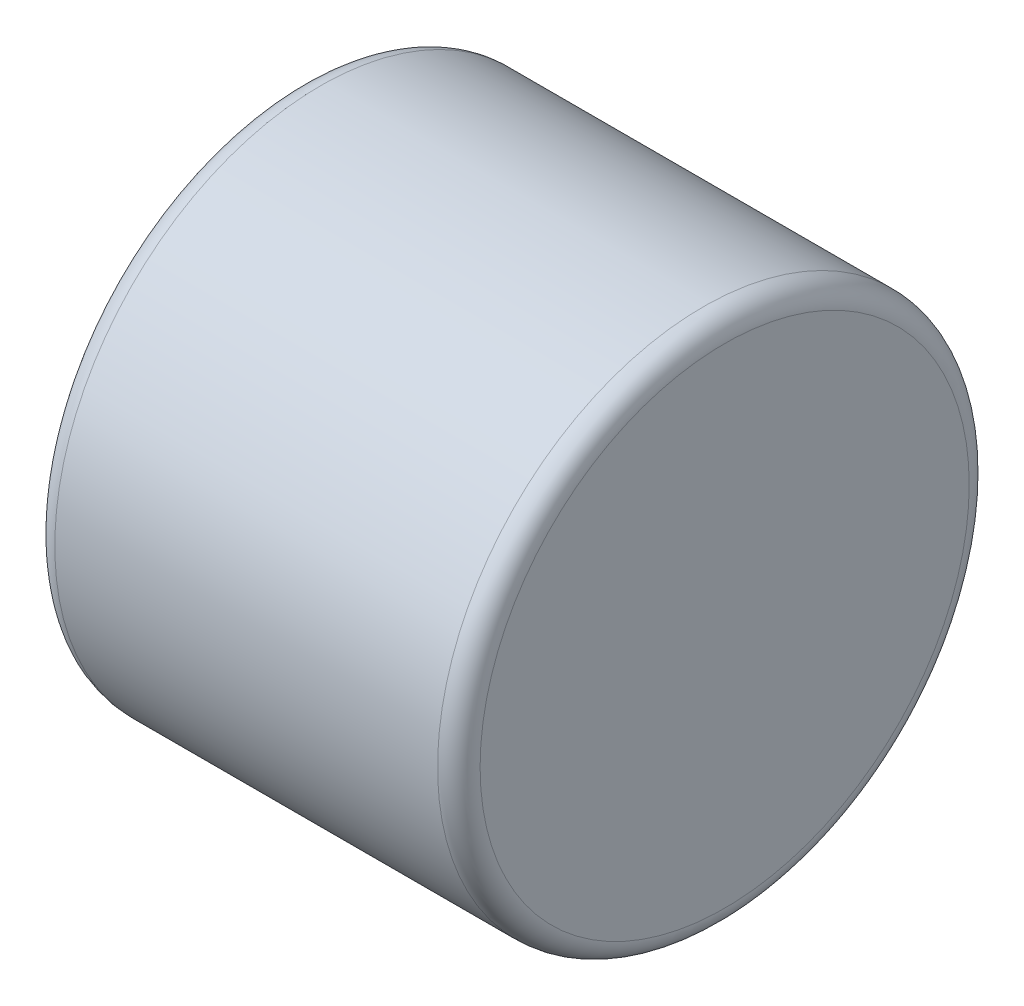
from build123d import *

# Parameters (mm, degrees)
SKETCH1_R      = 1.5875
EXTRUDE1_DEPTH = 2.54
FILLET1_R      = 0.127


with BuildPart() as part:
    # Sketch1 → Extrude1 (new body)
    with BuildSketch(Plane(origin=(0, 0, 0), x_dir=(0, 0, -1), z_dir=(1, 0, 0))):
        Circle(SKETCH1_R)
    extrude(amount=EXTRUDE1_DEPTH)

    # Fillet1
    fillet1_edges = [part.edges().sort_by_distance(p)[0] for p in [
        (0, 0, 1.5875),
        (2.54, 0, 1.5875),
    ]]
    fillet(fillet1_edges, radius=FILLET1_R)


solid = part.part
